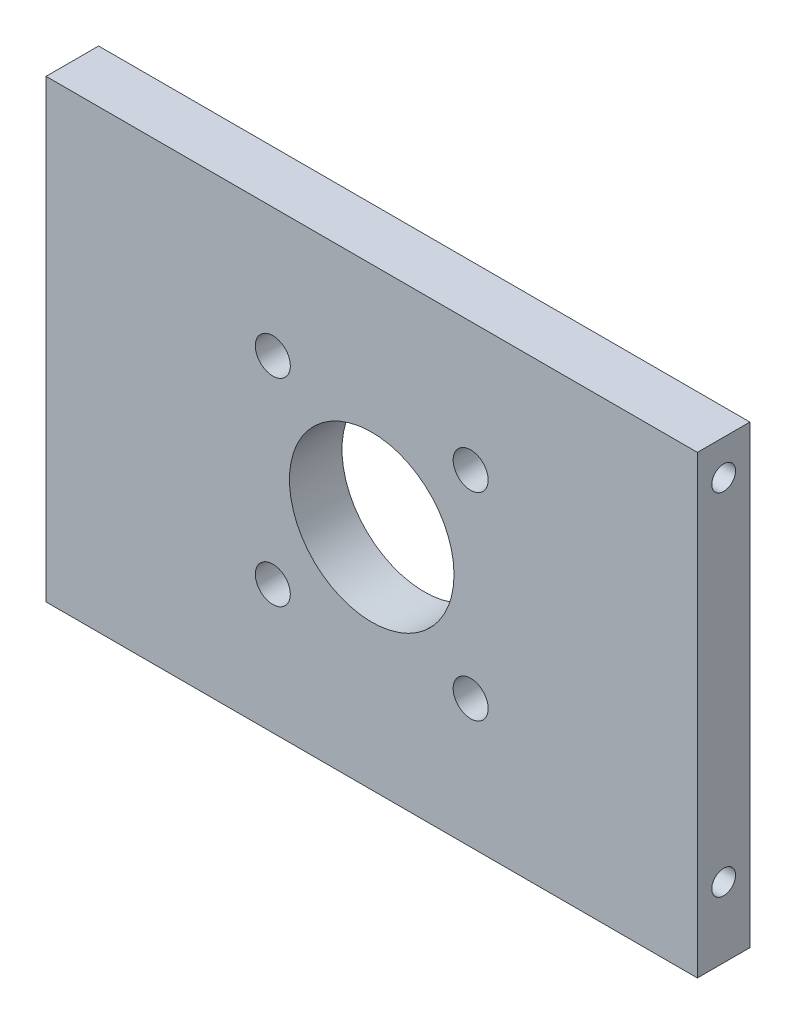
ISO-10303-21;
HEADER;
FILE_DESCRIPTION(('STEP AP214'),'2;1');
FILE_NAME('part.step','',(''),(''),'','','');
FILE_SCHEMA(('AUTOMOTIVE_DESIGN { 1 0 10303 214 1 1 1 1 }'));
ENDSEC;
DATA;
#1=APPLICATION_CONTEXT('core data for automotive mechanical design processes');
#2=APPLICATION_PROTOCOL_DEFINITION('international standard','automotive_design',2000,#1);
#3=PRODUCT_CONTEXT('',#1,'mechanical');
#4=PRODUCT('Part','Part','',(#3));
#5=PRODUCT_RELATED_PRODUCT_CATEGORY('part','',(#4));
#6=PRODUCT_DEFINITION_FORMATION('','',#4);
#7=PRODUCT_DEFINITION_CONTEXT('part definition',#1,'design');
#8=PRODUCT_DEFINITION('design','',#6,#7);
#9=PRODUCT_DEFINITION_SHAPE('','',#8);
#10=(LENGTH_UNIT() NAMED_UNIT(*) SI_UNIT(.MILLI.,.METRE.));
#11=(NAMED_UNIT(*) PLANE_ANGLE_UNIT() SI_UNIT($,.RADIAN.));
#12=(NAMED_UNIT(*) SI_UNIT($,.STERADIAN.) SOLID_ANGLE_UNIT());
#13=UNCERTAINTY_MEASURE_WITH_UNIT(LENGTH_MEASURE(1.E-05),#10,'distance_accuracy_value','');
#14=(GEOMETRIC_REPRESENTATION_CONTEXT(3) GLOBAL_UNCERTAINTY_ASSIGNED_CONTEXT((#13)) GLOBAL_UNIT_ASSIGNED_CONTEXT((#10,
#11,#12)) REPRESENTATION_CONTEXT('',''));
#15=CARTESIAN_POINT('',(0.,0.,0.));
#16=DIRECTION('',(0.,0.,1.));
#17=DIRECTION('',(1.,0.,0.));
#18=AXIS2_PLACEMENT_3D('',#15,#16,#17);
#19=CARTESIAN_POINT('',(-69.973130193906,63.6934903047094,15.0000000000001));
#20=DIRECTION('',(1.,0.,0.));
#21=DIRECTION('',(0.,1.,0.));
#22=AXIS2_PLACEMENT_3D('',#19,#20,#21);
#23=PLANE('',#22);
#24=CARTESIAN_POINT('',(-69.973130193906,53.6934903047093,7.49999999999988));
#25=DIRECTION('',(-1.,0.,0.));
#26=DIRECTION('',(0.,0.,1.));
#27=AXIS2_PLACEMENT_3D('',#24,#25,#26);
#28=CIRCLE('',#27,3.4);
#29=CARTESIAN_POINT('',(-69.973130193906,53.6934903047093,10.8999999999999));
#30=VERTEX_POINT('',#29);
#31=EDGE_CURVE('E111',#30,#30,#28,.T.);
#32=ORIENTED_EDGE('',*,*,#31,.F.);
#33=EDGE_LOOP('',(#32));
#34=FACE_BOUND('',#33,.T.);
#35=CARTESIAN_POINT('',(-69.9731301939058,-46.306509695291,7.49999999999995));
#36=DIRECTION('',(-1.,0.,0.));
#37=DIRECTION('',(0.,0.,1.));
#38=AXIS2_PLACEMENT_3D('',#35,#36,#37);
#39=CIRCLE('',#38,3.4);
#40=CARTESIAN_POINT('',(-69.9731301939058,-46.306509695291,10.9));
#41=VERTEX_POINT('',#40);
#42=EDGE_CURVE('E117',#41,#41,#39,.T.);
#43=ORIENTED_EDGE('',*,*,#42,.F.);
#44=EDGE_LOOP('',(#43));
#45=FACE_BOUND('',#44,.T.);
#46=DIRECTION('',(0.,-1.,0.));
#47=VECTOR('',#46,1.);
#48=CARTESIAN_POINT('',(-69.973130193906,63.6934903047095,-1.2490009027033E-13));
#49=LINE('',#48,#47);
#50=CARTESIAN_POINT('',(-69.973130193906,63.6934903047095,-1.2490009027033E-13));
#51=VERTEX_POINT('',#50);
#52=CARTESIAN_POINT('',(-69.9731301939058,-66.306509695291,0.));
#53=VERTEX_POINT('',#52);
#54=EDGE_CURVE('E126',#51,#53,#49,.T.);
#55=ORIENTED_EDGE('',*,*,#54,.T.);
#56=DIRECTION('',(0.,0.,-1.));
#57=VECTOR('',#56,1.);
#58=CARTESIAN_POINT('',(-69.9731301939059,-66.306509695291,14.9999999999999));
#59=LINE('',#58,#57);
#60=CARTESIAN_POINT('',(-69.9731301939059,-66.306509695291,14.9999999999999));
#61=VERTEX_POINT('',#60);
#62=EDGE_CURVE('E11',#61,#53,#59,.T.);
#63=ORIENTED_EDGE('',*,*,#62,.F.);
#64=DIRECTION('',(0.,-1.,0.));
#65=VECTOR('',#64,1.);
#66=CARTESIAN_POINT('',(-69.973130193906,63.6934903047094,15.0000000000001));
#67=LINE('',#66,#65);
#68=CARTESIAN_POINT('',(-69.973130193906,63.6934903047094,15.0000000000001));
#69=VERTEX_POINT('',#68);
#70=EDGE_CURVE('E135',#69,#61,#67,.T.);
#71=ORIENTED_EDGE('',*,*,#70,.F.);
#72=DIRECTION('',(0.,0.,-1.));
#73=VECTOR('',#72,1.);
#74=CARTESIAN_POINT('',(-69.973130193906,63.6934903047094,15.0000000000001));
#75=LINE('',#74,#73);
#76=EDGE_CURVE('E141',#69,#51,#75,.T.);
#77=ORIENTED_EDGE('',*,*,#76,.T.);
#78=EDGE_LOOP('',(#55,#63,#71,#77));
#79=FACE_BOUND('',#78,.T.);
#80=ADVANCED_FACE('F32',(#34,#45,#79),#23,.F.);
#81=CARTESIAN_POINT('',(-69.9731301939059,-66.306509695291,14.9999999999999));
#82=DIRECTION('',(0.,1.,0.));
#83=DIRECTION('',(0.,0.,1.));
#84=AXIS2_PLACEMENT_3D('',#81,#82,#83);
#85=PLANE('',#84);
#86=DIRECTION('',(1.,0.,0.));
#87=VECTOR('',#86,1.);
#88=CARTESIAN_POINT('',(-69.9731301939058,-66.306509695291,0.));
#89=LINE('',#88,#87);
#90=CARTESIAN_POINT('',(116.026869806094,-66.3065096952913,0.));
#91=VERTEX_POINT('',#90);
#92=EDGE_CURVE('E129',#53,#91,#89,.T.);
#93=ORIENTED_EDGE('',*,*,#92,.T.);
#94=DIRECTION('',(0.,0.,-1.));
#95=VECTOR('',#94,1.);
#96=CARTESIAN_POINT('',(116.026869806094,-66.3065096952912,15.));
#97=LINE('',#96,#95);
#98=CARTESIAN_POINT('',(116.026869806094,-66.3065096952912,15.));
#99=VERTEX_POINT('',#98);
#100=EDGE_CURVE('E39',#99,#91,#97,.T.);
#101=ORIENTED_EDGE('',*,*,#100,.F.);
#102=DIRECTION('',(1.,0.,0.));
#103=VECTOR('',#102,1.);
#104=CARTESIAN_POINT('',(-69.9731301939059,-66.306509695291,14.9999999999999));
#105=LINE('',#104,#103);
#106=EDGE_CURVE('E137',#61,#99,#105,.T.);
#107=ORIENTED_EDGE('',*,*,#106,.F.);
#108=ORIENTED_EDGE('',*,*,#62,.T.);
#109=EDGE_LOOP('',(#93,#101,#107,#108));
#110=FACE_BOUND('',#109,.T.);
#111=ADVANCED_FACE('F162',(#110),#85,.F.);
#112=CARTESIAN_POINT('',(116.026869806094,63.6934903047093,15.));
#113=DIRECTION('',(-1.,0.,0.));
#114=DIRECTION('',(0.,0.,1.));
#115=AXIS2_PLACEMENT_3D('',#112,#113,#114);
#116=PLANE('',#115);
#117=CARTESIAN_POINT('',(116.026869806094,53.6934903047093,7.50000000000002));
#118=DIRECTION('',(1.,0.,0.));
#119=DIRECTION('',(0.,0.,-1.));
#120=AXIS2_PLACEMENT_3D('',#117,#118,#119);
#121=CIRCLE('',#120,3.39999999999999);
#122=CARTESIAN_POINT('',(116.026869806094,53.6934903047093,4.10000000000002));
#123=VERTEX_POINT('',#122);
#124=EDGE_CURVE('E92',#123,#123,#121,.T.);
#125=ORIENTED_EDGE('',*,*,#124,.F.);
#126=EDGE_LOOP('',(#125));
#127=FACE_BOUND('',#126,.T.);
#128=CARTESIAN_POINT('',(116.026869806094,-46.306509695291,7.50000000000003));
#129=DIRECTION('',(1.,0.,0.));
#130=DIRECTION('',(0.,0.,-1.));
#131=AXIS2_PLACEMENT_3D('',#128,#129,#130);
#132=CIRCLE('',#131,3.39999999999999);
#133=CARTESIAN_POINT('',(116.026869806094,-46.306509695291,4.10000000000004));
#134=VERTEX_POINT('',#133);
#135=EDGE_CURVE('E105',#134,#134,#132,.T.);
#136=ORIENTED_EDGE('',*,*,#135,.F.);
#137=EDGE_LOOP('',(#136));
#138=FACE_BOUND('',#137,.T.);
#139=DIRECTION('',(0.,1.,0.));
#140=VECTOR('',#139,1.);
#141=CARTESIAN_POINT('',(116.026869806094,63.6934903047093,0.));
#142=LINE('',#141,#140);
#143=CARTESIAN_POINT('',(116.026869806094,63.6934903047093,0.));
#144=VERTEX_POINT('',#143);
#145=EDGE_CURVE('E131',#91,#144,#142,.T.);
#146=ORIENTED_EDGE('',*,*,#145,.T.);
#147=DIRECTION('',(0.,0.,-1.));
#148=VECTOR('',#147,1.);
#149=CARTESIAN_POINT('',(116.026869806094,63.6934903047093,15.));
#150=LINE('',#149,#148);
#151=CARTESIAN_POINT('',(116.026869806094,63.6934903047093,15.));
#152=VERTEX_POINT('',#151);
#153=EDGE_CURVE('E144',#152,#144,#150,.T.);
#154=ORIENTED_EDGE('',*,*,#153,.F.);
#155=DIRECTION('',(0.,1.,0.));
#156=VECTOR('',#155,1.);
#157=CARTESIAN_POINT('',(116.026869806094,63.6934903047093,15.));
#158=LINE('',#157,#156);
#159=EDGE_CURVE('E51',#99,#152,#158,.T.);
#160=ORIENTED_EDGE('',*,*,#159,.F.);
#161=ORIENTED_EDGE('',*,*,#100,.T.);
#162=EDGE_LOOP('',(#146,#154,#160,#161));
#163=FACE_BOUND('',#162,.T.);
#164=ADVANCED_FACE('F150',(#127,#138,#163),#116,.F.);
#165=CARTESIAN_POINT('',(-69.973130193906,63.6934903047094,15.0000000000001));
#166=DIRECTION('',(0.,-1.,0.));
#167=DIRECTION('',(0.,0.,-1.));
#168=AXIS2_PLACEMENT_3D('',#165,#166,#167);
#169=PLANE('',#168);
#170=DIRECTION('',(-1.,0.,0.));
#171=VECTOR('',#170,1.);
#172=CARTESIAN_POINT('',(-69.973130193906,63.6934903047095,-1.2490009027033E-13));
#173=LINE('',#172,#171);
#174=EDGE_CURVE('E133',#144,#51,#173,.T.);
#175=ORIENTED_EDGE('',*,*,#174,.T.);
#176=ORIENTED_EDGE('',*,*,#76,.F.);
#177=DIRECTION('',(-1.,0.,0.));
#178=VECTOR('',#177,1.);
#179=CARTESIAN_POINT('',(-69.973130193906,63.6934903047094,15.0000000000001));
#180=LINE('',#179,#178);
#181=EDGE_CURVE('E46',#152,#69,#180,.T.);
#182=ORIENTED_EDGE('',*,*,#181,.F.);
#183=ORIENTED_EDGE('',*,*,#153,.T.);
#184=EDGE_LOOP('',(#175,#176,#182,#183));
#185=FACE_BOUND('',#184,.T.);
#186=ADVANCED_FACE('F157',(#185),#169,.F.);
#187=CARTESIAN_POINT('',(-69.9731301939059,-66.306509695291,14.9999999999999));
#188=DIRECTION('',(0.,0.,1.));
#189=DIRECTION('',(1.,0.,0.));
#190=AXIS2_PLACEMENT_3D('',#187,#188,#189);
#191=PLANE('',#190);
#192=CARTESIAN_POINT('',(51.2768698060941,-29.556509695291,15.0000000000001));
#193=DIRECTION('',(0.,0.,1.));
#194=DIRECTION('',(1.,0.,0.));
#195=AXIS2_PLACEMENT_3D('',#192,#193,#194);
#196=CIRCLE('',#195,5.);
#197=CARTESIAN_POINT('',(56.2768698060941,-29.556509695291,15.0000000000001));
#198=VERTEX_POINT('',#197);
#199=EDGE_CURVE('E229',#198,#198,#196,.T.);
#200=ORIENTED_EDGE('',*,*,#199,.F.);
#201=EDGE_LOOP('',(#200));
#202=FACE_BOUND('',#201,.T.);
#203=CARTESIAN_POINT('',(51.2768698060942,26.9434903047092,15.));
#204=DIRECTION('',(0.,0.,1.));
#205=DIRECTION('',(1.,0.,0.));
#206=AXIS2_PLACEMENT_3D('',#203,#204,#205);
#207=CIRCLE('',#206,5.);
#208=CARTESIAN_POINT('',(56.2768698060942,26.9434903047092,15.));
#209=VERTEX_POINT('',#208);
#210=EDGE_CURVE('E239',#209,#209,#207,.T.);
#211=ORIENTED_EDGE('',*,*,#210,.F.);
#212=EDGE_LOOP('',(#211));
#213=FACE_BOUND('',#212,.T.);
#214=CARTESIAN_POINT('',(-5.22313019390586,-29.556509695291,14.9999999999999));
#215=DIRECTION('',(0.,0.,1.));
#216=DIRECTION('',(1.,0.,0.));
#217=AXIS2_PLACEMENT_3D('',#214,#215,#216);
#218=CIRCLE('',#217,5.);
#219=CARTESIAN_POINT('',(-0.223130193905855,-29.556509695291,14.9999999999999));
#220=VERTEX_POINT('',#219);
#221=EDGE_CURVE('E245',#220,#220,#218,.T.);
#222=ORIENTED_EDGE('',*,*,#221,.F.);
#223=EDGE_LOOP('',(#222));
#224=FACE_BOUND('',#223,.T.);
#225=CARTESIAN_POINT('',(-5.22313019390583,26.9434903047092,15.));
#226=DIRECTION('',(0.,0.,1.));
#227=DIRECTION('',(1.,0.,0.));
#228=AXIS2_PLACEMENT_3D('',#225,#226,#227);
#229=CIRCLE('',#228,5.);
#230=CARTESIAN_POINT('',(-0.223130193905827,26.9434903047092,15.));
#231=VERTEX_POINT('',#230);
#232=EDGE_CURVE('E93',#231,#231,#229,.T.);
#233=ORIENTED_EDGE('',*,*,#232,.F.);
#234=EDGE_LOOP('',(#233));
#235=FACE_BOUND('',#234,.T.);
#236=CARTESIAN_POINT('',(23.0268698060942,-1.30650969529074,14.9999999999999));
#237=DIRECTION('',(0.,0.,1.));
#238=DIRECTION('',(1.,0.,0.));
#239=AXIS2_PLACEMENT_3D('',#236,#237,#238);
#240=CIRCLE('',#239,23.5);
#241=CARTESIAN_POINT('',(46.5268698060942,-1.30650969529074,14.9999999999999));
#242=VERTEX_POINT('',#241);
#243=EDGE_CURVE('E120',#242,#242,#240,.T.);
#244=ORIENTED_EDGE('',*,*,#243,.F.);
#245=EDGE_LOOP('',(#244));
#246=FACE_BOUND('',#245,.T.);
#247=ORIENTED_EDGE('',*,*,#70,.T.);
#248=ORIENTED_EDGE('',*,*,#106,.T.);
#249=ORIENTED_EDGE('',*,*,#159,.T.);
#250=ORIENTED_EDGE('',*,*,#181,.T.);
#251=EDGE_LOOP('',(#247,#248,#249,#250));
#252=FACE_BOUND('',#251,.T.);
#253=ADVANCED_FACE('F161',(#202,#213,#224,#235,#246,#252),#191,.T.);
#254=CARTESIAN_POINT('',(-69.9731301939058,-66.306509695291,0.));
#255=DIRECTION('',(0.,0.,1.));
#256=DIRECTION('',(1.,0.,0.));
#257=AXIS2_PLACEMENT_3D('',#254,#255,#256);
#258=PLANE('',#257);
#259=CARTESIAN_POINT('',(51.2768698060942,-29.556509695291,-1.2490009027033E-13));
#260=DIRECTION('',(0.,0.,-1.));
#261=DIRECTION('',(-1.,0.,0.));
#262=AXIS2_PLACEMENT_3D('',#259,#260,#261);
#263=CIRCLE('',#262,5.);
#264=CARTESIAN_POINT('',(46.2768698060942,-29.556509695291,-1.2490009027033E-13));
#265=VERTEX_POINT('',#264);
#266=EDGE_CURVE('E232',#265,#265,#263,.T.);
#267=ORIENTED_EDGE('',*,*,#266,.F.);
#268=EDGE_LOOP('',(#267));
#269=FACE_BOUND('',#268,.T.);
#270=CARTESIAN_POINT('',(51.2768698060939,26.9434903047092,0.));
#271=DIRECTION('',(0.,0.,-1.));
#272=DIRECTION('',(-1.,0.,0.));
#273=AXIS2_PLACEMENT_3D('',#270,#271,#272);
#274=CIRCLE('',#273,5.);
#275=CARTESIAN_POINT('',(46.2768698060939,26.9434903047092,0.));
#276=VERTEX_POINT('',#275);
#277=EDGE_CURVE('E234',#276,#276,#274,.T.);
#278=ORIENTED_EDGE('',*,*,#277,.F.);
#279=EDGE_LOOP('',(#278));
#280=FACE_BOUND('',#279,.T.);
#281=CARTESIAN_POINT('',(-5.22313019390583,-29.556509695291,-1.2490009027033E-13));
#282=DIRECTION('',(0.,0.,-1.));
#283=DIRECTION('',(-1.,0.,0.));
#284=AXIS2_PLACEMENT_3D('',#281,#282,#283);
#285=CIRCLE('',#284,5.);
#286=CARTESIAN_POINT('',(-10.2231301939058,-29.556509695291,-1.2490009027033E-13));
#287=VERTEX_POINT('',#286);
#288=EDGE_CURVE('E242',#287,#287,#285,.T.);
#289=ORIENTED_EDGE('',*,*,#288,.F.);
#290=EDGE_LOOP('',(#289));
#291=FACE_BOUND('',#290,.T.);
#292=CARTESIAN_POINT('',(-5.22313019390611,26.9434903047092,0.));
#293=DIRECTION('',(0.,0.,-1.));
#294=DIRECTION('',(-1.,0.,0.));
#295=AXIS2_PLACEMENT_3D('',#292,#293,#294);
#296=CIRCLE('',#295,5.);
#297=CARTESIAN_POINT('',(-10.2231301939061,26.9434903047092,0.));
#298=VERTEX_POINT('',#297);
#299=EDGE_CURVE('E99',#298,#298,#296,.T.);
#300=ORIENTED_EDGE('',*,*,#299,.F.);
#301=EDGE_LOOP('',(#300));
#302=FACE_BOUND('',#301,.T.);
#303=CARTESIAN_POINT('',(23.0268698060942,-1.30650969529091,-2.22044604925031E-13));
#304=DIRECTION('',(0.,0.,1.));
#305=DIRECTION('',(1.,0.,0.));
#306=AXIS2_PLACEMENT_3D('',#303,#304,#305);
#307=CIRCLE('',#306,23.5);
#308=CARTESIAN_POINT('',(46.5268698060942,-1.30650969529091,-2.22044604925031E-13));
#309=VERTEX_POINT('',#308);
#310=EDGE_CURVE('E123',#309,#309,#307,.T.);
#311=ORIENTED_EDGE('',*,*,#310,.T.);
#312=EDGE_LOOP('',(#311));
#313=FACE_BOUND('',#312,.T.);
#314=ORIENTED_EDGE('',*,*,#54,.F.);
#315=ORIENTED_EDGE('',*,*,#174,.F.);
#316=ORIENTED_EDGE('',*,*,#145,.F.);
#317=ORIENTED_EDGE('',*,*,#92,.F.);
#318=EDGE_LOOP('',(#314,#315,#316,#317));
#319=FACE_BOUND('',#318,.T.);
#320=ADVANCED_FACE('F155',(#269,#280,#291,#302,#313,#319),#258,.F.);
#321=CARTESIAN_POINT('',(23.0268698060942,-1.30650969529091,-2.22044604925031E-13));
#322=DIRECTION('',(0.,0.,1.));
#323=DIRECTION('',(1.,0.,0.));
#324=AXIS2_PLACEMENT_3D('',#321,#322,#323);
#325=CYLINDRICAL_SURFACE('',#324,23.5);
#326=ORIENTED_EDGE('',*,*,#310,.F.);
#327=EDGE_LOOP('',(#326));
#328=FACE_BOUND('',#327,.T.);
#329=ORIENTED_EDGE('',*,*,#243,.T.);
#330=EDGE_LOOP('',(#329));
#331=FACE_BOUND('',#330,.T.);
#332=ADVANCED_FACE('F179',(#328,#331),#325,.F.);
#333=CARTESIAN_POINT('',(-69.9731301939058,-46.306509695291,7.49999999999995));
#334=DIRECTION('',(-1.,0.,0.));
#335=DIRECTION('',(0.,0.,1.));
#336=AXIS2_PLACEMENT_3D('',#333,#334,#335);
#337=CYLINDRICAL_SURFACE('',#336,3.39999999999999);
#338=CARTESIAN_POINT('',(-23.7231301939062,-46.3065096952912,7.49999999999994));
#339=DIRECTION('',(-1.,0.,0.));
#340=DIRECTION('',(0.,0.,1.));
#341=AXIS2_PLACEMENT_3D('',#338,#339,#340);
#342=CIRCLE('',#341,3.39999999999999);
#343=CARTESIAN_POINT('',(-23.7231301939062,-46.3065096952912,10.8999999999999));
#344=VERTEX_POINT('',#343);
#345=EDGE_CURVE('E114',#344,#344,#342,.T.);
#346=ORIENTED_EDGE('',*,*,#345,.F.);
#347=EDGE_LOOP('',(#346));
#348=FACE_BOUND('',#347,.T.);
#349=ORIENTED_EDGE('',*,*,#42,.T.);
#350=EDGE_LOOP('',(#349));
#351=FACE_BOUND('',#350,.T.);
#352=ADVANCED_FACE('F183',(#348,#351),#337,.F.);
#353=CARTESIAN_POINT('',(-23.7231301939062,-46.3065096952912,7.49999999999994));
#354=DIRECTION('',(-1.,0.,0.));
#355=DIRECTION('',(0.,0.,1.));
#356=AXIS2_PLACEMENT_3D('',#353,#354,#355);
#357=CONICAL_SURFACE('',#356,3.39999999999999,1.02974425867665);
#358=CARTESIAN_POINT('',(-21.6802040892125,-46.3065096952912,7.49999999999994));
#359=VERTEX_POINT('',#358);
#360=VERTEX_LOOP('',#359);
#361=FACE_BOUND('',#360,.T.);
#362=ORIENTED_EDGE('',*,*,#345,.T.);
#363=EDGE_LOOP('',(#362));
#364=FACE_BOUND('',#363,.T.);
#365=ADVANCED_FACE('F187',(#361,#364),#357,.F.);
#366=CARTESIAN_POINT('',(-69.973130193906,53.6934903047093,7.49999999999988));
#367=DIRECTION('',(-1.,0.,0.));
#368=DIRECTION('',(0.,0.,1.));
#369=AXIS2_PLACEMENT_3D('',#366,#367,#368);
#370=CYLINDRICAL_SURFACE('',#369,3.39999999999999);
#371=CARTESIAN_POINT('',(-23.7231301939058,53.6934903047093,7.49999999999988));
#372=DIRECTION('',(-1.,0.,0.));
#373=DIRECTION('',(0.,0.,1.));
#374=AXIS2_PLACEMENT_3D('',#371,#372,#373);
#375=CIRCLE('',#374,3.39999999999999);
#376=CARTESIAN_POINT('',(-23.7231301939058,53.6934903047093,10.8999999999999));
#377=VERTEX_POINT('',#376);
#378=EDGE_CURVE('E108',#377,#377,#375,.T.);
#379=ORIENTED_EDGE('',*,*,#378,.F.);
#380=EDGE_LOOP('',(#379));
#381=FACE_BOUND('',#380,.T.);
#382=ORIENTED_EDGE('',*,*,#31,.T.);
#383=EDGE_LOOP('',(#382));
#384=FACE_BOUND('',#383,.T.);
#385=ADVANCED_FACE('F191',(#381,#384),#370,.F.);
#386=CARTESIAN_POINT('',(-23.7231301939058,53.6934903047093,7.49999999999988));
#387=DIRECTION('',(-1.,0.,0.));
#388=DIRECTION('',(0.,0.,1.));
#389=AXIS2_PLACEMENT_3D('',#386,#387,#388);
#390=CONICAL_SURFACE('',#389,3.39999999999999,1.02974425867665);
#391=CARTESIAN_POINT('',(-21.6802040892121,53.6934903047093,7.49999999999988));
#392=VERTEX_POINT('',#391);
#393=VERTEX_LOOP('',#392);
#394=FACE_BOUND('',#393,.T.);
#395=ORIENTED_EDGE('',*,*,#378,.T.);
#396=EDGE_LOOP('',(#395));
#397=FACE_BOUND('',#396,.T.);
#398=ADVANCED_FACE('F195',(#394,#397),#390,.F.);
#399=CARTESIAN_POINT('',(116.026869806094,-46.306509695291,7.50000000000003));
#400=DIRECTION('',(1.,0.,0.));
#401=DIRECTION('',(0.,0.,-1.));
#402=AXIS2_PLACEMENT_3D('',#399,#400,#401);
#403=CYLINDRICAL_SURFACE('',#402,3.39999999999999);
#404=CARTESIAN_POINT('',(69.7768698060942,-46.3065096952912,7.49999999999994));
#405=DIRECTION('',(1.,0.,0.));
#406=DIRECTION('',(0.,0.,-1.));
#407=AXIS2_PLACEMENT_3D('',#404,#405,#406);
#408=CIRCLE('',#407,3.39999999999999);
#409=CARTESIAN_POINT('',(69.7768698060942,-46.3065096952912,4.09999999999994));
#410=VERTEX_POINT('',#409);
#411=EDGE_CURVE('E96',#410,#410,#408,.T.);
#412=ORIENTED_EDGE('',*,*,#411,.F.);
#413=EDGE_LOOP('',(#412));
#414=FACE_BOUND('',#413,.T.);
#415=ORIENTED_EDGE('',*,*,#135,.T.);
#416=EDGE_LOOP('',(#415));
#417=FACE_BOUND('',#416,.T.);
#418=ADVANCED_FACE('F199',(#414,#417),#403,.F.);
#419=CARTESIAN_POINT('',(69.7768698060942,-46.3065096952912,7.49999999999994));
#420=DIRECTION('',(1.,0.,0.));
#421=DIRECTION('',(0.,0.,-1.));
#422=AXIS2_PLACEMENT_3D('',#419,#420,#421);
#423=CONICAL_SURFACE('',#422,3.39999999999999,1.02974425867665);
#424=CARTESIAN_POINT('',(67.7339437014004,-46.3065096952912,7.49999999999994));
#425=VERTEX_POINT('',#424);
#426=VERTEX_LOOP('',#425);
#427=FACE_BOUND('',#426,.T.);
#428=ORIENTED_EDGE('',*,*,#411,.T.);
#429=EDGE_LOOP('',(#428));
#430=FACE_BOUND('',#429,.T.);
#431=ADVANCED_FACE('F203',(#427,#430),#423,.F.);
#432=CARTESIAN_POINT('',(116.026869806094,53.6934903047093,7.50000000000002));
#433=DIRECTION('',(1.,0.,0.));
#434=DIRECTION('',(0.,0.,-1.));
#435=AXIS2_PLACEMENT_3D('',#432,#433,#434);
#436=CYLINDRICAL_SURFACE('',#435,3.39999999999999);
#437=CARTESIAN_POINT('',(69.7768698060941,53.6934903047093,7.49999999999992));
#438=DIRECTION('',(1.,0.,0.));
#439=DIRECTION('',(0.,0.,-1.));
#440=AXIS2_PLACEMENT_3D('',#437,#438,#439);
#441=CIRCLE('',#440,3.39999999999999);
#442=CARTESIAN_POINT('',(69.7768698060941,53.6934903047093,4.09999999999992));
#443=VERTEX_POINT('',#442);
#444=EDGE_CURVE('E90',#443,#443,#441,.T.);
#445=ORIENTED_EDGE('',*,*,#444,.F.);
#446=EDGE_LOOP('',(#445));
#447=FACE_BOUND('',#446,.T.);
#448=ORIENTED_EDGE('',*,*,#124,.T.);
#449=EDGE_LOOP('',(#448));
#450=FACE_BOUND('',#449,.T.);
#451=ADVANCED_FACE('F86',(#447,#450),#436,.F.);
#452=CARTESIAN_POINT('',(69.7768698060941,53.6934903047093,7.49999999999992));
#453=DIRECTION('',(1.,0.,0.));
#454=DIRECTION('',(0.,0.,-1.));
#455=AXIS2_PLACEMENT_3D('',#452,#453,#454);
#456=CONICAL_SURFACE('',#455,3.39999999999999,1.02974425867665);
#457=CARTESIAN_POINT('',(67.7339437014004,53.6934903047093,7.49999999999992));
#458=VERTEX_POINT('',#457);
#459=VERTEX_LOOP('',#458);
#460=FACE_BOUND('',#459,.T.);
#461=ORIENTED_EDGE('',*,*,#444,.T.);
#462=EDGE_LOOP('',(#461));
#463=FACE_BOUND('',#462,.T.);
#464=ADVANCED_FACE('F82',(#460,#463),#456,.F.);
#465=CARTESIAN_POINT('',(-5.22313019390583,26.9434903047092,20.));
#466=DIRECTION('',(0.,0.,-1.));
#467=DIRECTION('',(-1.,0.,0.));
#468=AXIS2_PLACEMENT_3D('',#465,#466,#467);
#469=CYLINDRICAL_SURFACE('',#468,5.);
#470=ORIENTED_EDGE('',*,*,#232,.T.);
#471=EDGE_LOOP('',(#470));
#472=FACE_BOUND('',#471,.T.);
#473=ORIENTED_EDGE('',*,*,#299,.T.);
#474=EDGE_LOOP('',(#473));
#475=FACE_BOUND('',#474,.T.);
#476=ADVANCED_FACE('F85',(#472,#475),#469,.F.);
#477=CARTESIAN_POINT('',(-5.22313019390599,-29.556509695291,20.));
#478=DIRECTION('',(0.,0.,-1.));
#479=DIRECTION('',(-1.,0.,0.));
#480=AXIS2_PLACEMENT_3D('',#477,#478,#479);
#481=CYLINDRICAL_SURFACE('',#480,5.);
#482=ORIENTED_EDGE('',*,*,#221,.T.);
#483=EDGE_LOOP('',(#482));
#484=FACE_BOUND('',#483,.T.);
#485=ORIENTED_EDGE('',*,*,#288,.T.);
#486=EDGE_LOOP('',(#485));
#487=FACE_BOUND('',#486,.T.);
#488=ADVANCED_FACE('F212',(#484,#487),#481,.F.);
#489=CARTESIAN_POINT('',(51.2768698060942,26.9434903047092,20.));
#490=DIRECTION('',(0.,0.,-1.));
#491=DIRECTION('',(-1.,0.,0.));
#492=AXIS2_PLACEMENT_3D('',#489,#490,#491);
#493=CYLINDRICAL_SURFACE('',#492,5.);
#494=ORIENTED_EDGE('',*,*,#210,.T.);
#495=EDGE_LOOP('',(#494));
#496=FACE_BOUND('',#495,.T.);
#497=ORIENTED_EDGE('',*,*,#277,.T.);
#498=EDGE_LOOP('',(#497));
#499=FACE_BOUND('',#498,.T.);
#500=ADVANCED_FACE('F216',(#496,#499),#493,.F.);
#501=CARTESIAN_POINT('',(51.2768698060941,-29.556509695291,20.0000000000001));
#502=DIRECTION('',(0.,0.,-1.));
#503=DIRECTION('',(-1.,0.,0.));
#504=AXIS2_PLACEMENT_3D('',#501,#502,#503);
#505=CYLINDRICAL_SURFACE('',#504,5.);
#506=ORIENTED_EDGE('',*,*,#199,.T.);
#507=EDGE_LOOP('',(#506));
#508=FACE_BOUND('',#507,.T.);
#509=ORIENTED_EDGE('',*,*,#266,.T.);
#510=EDGE_LOOP('',(#509));
#511=FACE_BOUND('',#510,.T.);
#512=ADVANCED_FACE('F220',(#508,#511),#505,.F.);
#513=CLOSED_SHELL('',(#80,#111,#164,#186,#253,#320,#332,#352,#365,#385,#398,#418,#431,#451,#464,
#476,#488,#500,#512));
#514=MANIFOLD_SOLID_BREP('B2',#513);
#515=ADVANCED_BREP_SHAPE_REPRESENTATION('',(#18,#514),#14);
#516=SHAPE_DEFINITION_REPRESENTATION(#9,#515);
ENDSEC;
END-ISO-10303-21;
